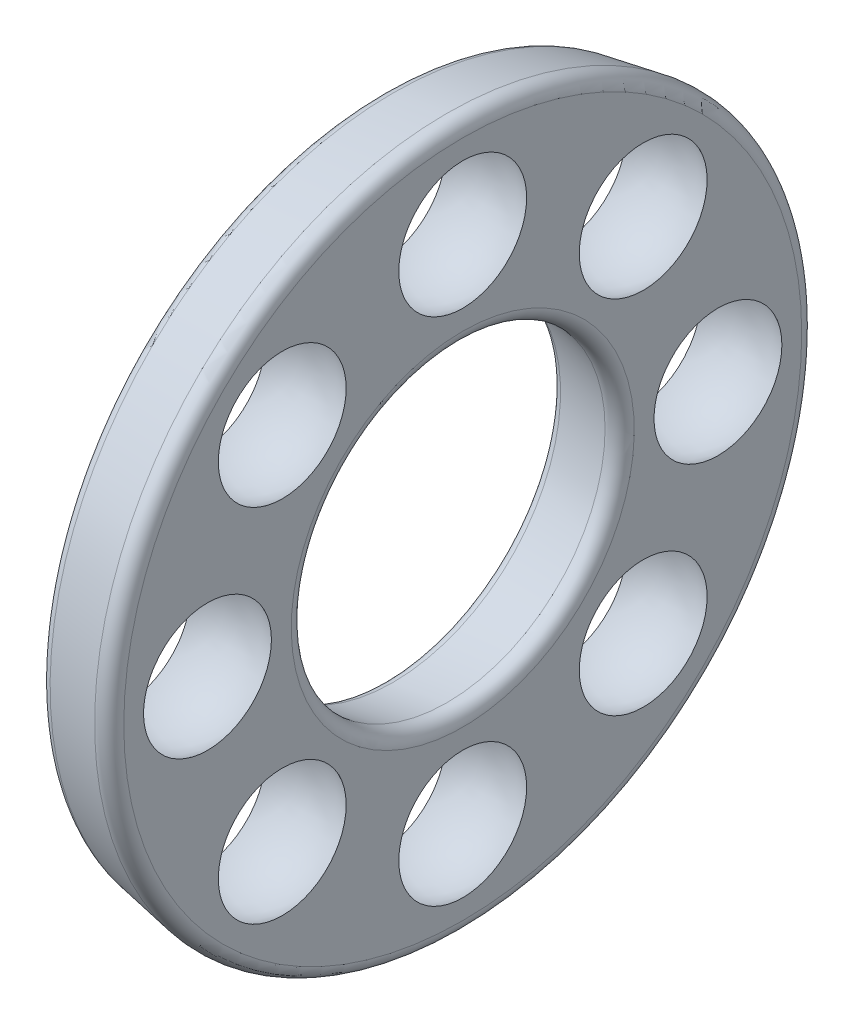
ISO-10303-21;
HEADER;
FILE_DESCRIPTION(('STEP AP214'),'2;1');
FILE_NAME('part.step','',(''),(''),'','','');
FILE_SCHEMA(('AUTOMOTIVE_DESIGN { 1 0 10303 214 1 1 1 1 }'));
ENDSEC;
DATA;
#1=APPLICATION_CONTEXT('core data for automotive mechanical design processes');
#2=APPLICATION_PROTOCOL_DEFINITION('international standard','automotive_design',2000,#1);
#3=PRODUCT_CONTEXT('',#1,'mechanical');
#4=PRODUCT('Part','Part','',(#3));
#5=PRODUCT_RELATED_PRODUCT_CATEGORY('part','',(#4));
#6=PRODUCT_DEFINITION_FORMATION('','',#4);
#7=PRODUCT_DEFINITION_CONTEXT('part definition',#1,'design');
#8=PRODUCT_DEFINITION('design','',#6,#7);
#9=PRODUCT_DEFINITION_SHAPE('','',#8);
#10=(LENGTH_UNIT() NAMED_UNIT(*) SI_UNIT(.MILLI.,.METRE.));
#11=(NAMED_UNIT(*) PLANE_ANGLE_UNIT() SI_UNIT($,.RADIAN.));
#12=(NAMED_UNIT(*) SI_UNIT($,.STERADIAN.) SOLID_ANGLE_UNIT());
#13=UNCERTAINTY_MEASURE_WITH_UNIT(LENGTH_MEASURE(1.E-05),#10,'distance_accuracy_value','');
#14=(GEOMETRIC_REPRESENTATION_CONTEXT(3) GLOBAL_UNCERTAINTY_ASSIGNED_CONTEXT((#13)) GLOBAL_UNIT_ASSIGNED_CONTEXT((#10,
#11,#12)) REPRESENTATION_CONTEXT('',''));
#15=CARTESIAN_POINT('',(0.,0.,0.));
#16=DIRECTION('',(0.,0.,1.));
#17=DIRECTION('',(1.,0.,0.));
#18=AXIS2_PLACEMENT_3D('',#15,#16,#17);
#19=CARTESIAN_POINT('',(3.15,8.5,0.));
#20=DIRECTION('',(-1.,0.,0.));
#21=DIRECTION('',(0.,0.,1.));
#22=AXIS2_PLACEMENT_3D('',#19,#20,#21);
#23=PLANE('',#22);
#24=CARTESIAN_POINT('',(3.15,0.,0.));
#25=DIRECTION('',(-1.,0.,0.));
#26=DIRECTION('',(0.,1.,0.));
#27=AXIS2_PLACEMENT_3D('',#24,#25,#26);
#28=CIRCLE('',#27,6.02867768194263);
#29=CARTESIAN_POINT('',(3.15,6.02867768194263,0.));
#30=VERTEX_POINT('',#29);
#31=EDGE_CURVE('E62',#30,#30,#28,.T.);
#32=ORIENTED_EDGE('',*,*,#31,.F.);
#33=EDGE_LOOP('',(#32));
#34=FACE_BOUND('',#33,.T.);
#35=CARTESIAN_POINT('',(3.15,8.5,0.));
#36=DIRECTION('',(1.,0.,0.));
#37=DIRECTION('',(0.,0.,-1.));
#38=AXIS2_PLACEMENT_3D('',#35,#36,#37);
#39=CIRCLE('',#38,2.12788627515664);
#40=CARTESIAN_POINT('',(3.15,8.5,-2.12788627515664));
#41=VERTEX_POINT('',#40);
#42=EDGE_CURVE('E10',#41,#41,#39,.T.);
#43=ORIENTED_EDGE('',*,*,#42,.T.);
#44=EDGE_LOOP('',(#43));
#45=FACE_BOUND('',#44,.T.);
#46=CARTESIAN_POINT('',(3.15,6.01040764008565,-6.01040764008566));
#47=DIRECTION('',(1.,0.,0.));
#48=DIRECTION('',(0.,0.,-1.));
#49=AXIS2_PLACEMENT_3D('',#46,#47,#48);
#50=CIRCLE('',#49,2.12788627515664);
#51=CARTESIAN_POINT('',(3.15,6.01040764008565,-8.1382939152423));
#52=VERTEX_POINT('',#51);
#53=EDGE_CURVE('E23',#52,#52,#50,.T.);
#54=ORIENTED_EDGE('',*,*,#53,.T.);
#55=EDGE_LOOP('',(#54));
#56=FACE_BOUND('',#55,.T.);
#57=CARTESIAN_POINT('',(3.15,0.,-8.5));
#58=DIRECTION('',(1.,0.,0.));
#59=DIRECTION('',(0.,0.,-1.));
#60=AXIS2_PLACEMENT_3D('',#57,#58,#59);
#61=CIRCLE('',#60,2.12788627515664);
#62=CARTESIAN_POINT('',(3.15,0.,-10.6278862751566));
#63=VERTEX_POINT('',#62);
#64=EDGE_CURVE('E28',#63,#63,#61,.T.);
#65=ORIENTED_EDGE('',*,*,#64,.T.);
#66=EDGE_LOOP('',(#65));
#67=FACE_BOUND('',#66,.T.);
#68=CARTESIAN_POINT('',(3.15,-6.01040764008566,-6.01040764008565));
#69=DIRECTION('',(1.,0.,0.));
#70=DIRECTION('',(0.,0.,-1.));
#71=AXIS2_PLACEMENT_3D('',#68,#69,#70);
#72=CIRCLE('',#71,2.12788627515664);
#73=CARTESIAN_POINT('',(3.15,-6.01040764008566,-8.13829391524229));
#74=VERTEX_POINT('',#73);
#75=EDGE_CURVE('E51',#74,#74,#72,.T.);
#76=ORIENTED_EDGE('',*,*,#75,.T.);
#77=EDGE_LOOP('',(#76));
#78=FACE_BOUND('',#77,.T.);
#79=CARTESIAN_POINT('',(3.15,-8.5,0.));
#80=DIRECTION('',(1.,0.,0.));
#81=DIRECTION('',(0.,0.,-1.));
#82=AXIS2_PLACEMENT_3D('',#79,#80,#81);
#83=CIRCLE('',#82,2.12788627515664);
#84=CARTESIAN_POINT('',(3.15,-8.5,-2.12788627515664));
#85=VERTEX_POINT('',#84);
#86=EDGE_CURVE('E48',#85,#85,#83,.T.);
#87=ORIENTED_EDGE('',*,*,#86,.T.);
#88=EDGE_LOOP('',(#87));
#89=FACE_BOUND('',#88,.T.);
#90=CARTESIAN_POINT('',(3.15,-6.01040764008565,6.01040764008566));
#91=DIRECTION('',(1.,0.,0.));
#92=DIRECTION('',(0.,0.,-1.));
#93=AXIS2_PLACEMENT_3D('',#90,#91,#92);
#94=CIRCLE('',#93,2.12788627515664);
#95=CARTESIAN_POINT('',(3.15,-6.01040764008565,3.88252136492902));
#96=VERTEX_POINT('',#95);
#97=EDGE_CURVE('E52',#96,#96,#94,.T.);
#98=ORIENTED_EDGE('',*,*,#97,.T.);
#99=EDGE_LOOP('',(#98));
#100=FACE_BOUND('',#99,.T.);
#101=CARTESIAN_POINT('',(3.15,0.,8.5));
#102=DIRECTION('',(1.,0.,0.));
#103=DIRECTION('',(0.,0.,-1.));
#104=AXIS2_PLACEMENT_3D('',#101,#102,#103);
#105=CIRCLE('',#104,2.12788627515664);
#106=CARTESIAN_POINT('',(3.15,0.,6.37211372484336));
#107=VERTEX_POINT('',#106);
#108=EDGE_CURVE('E31',#107,#107,#105,.T.);
#109=ORIENTED_EDGE('',*,*,#108,.T.);
#110=EDGE_LOOP('',(#109));
#111=FACE_BOUND('',#110,.T.);
#112=CARTESIAN_POINT('',(3.15,6.01040764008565,6.01040764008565));
#113=DIRECTION('',(1.,0.,0.));
#114=DIRECTION('',(0.,0.,-1.));
#115=AXIS2_PLACEMENT_3D('',#112,#113,#114);
#116=CIRCLE('',#115,2.12788627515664);
#117=CARTESIAN_POINT('',(3.15,6.01040764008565,3.88252136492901));
#118=VERTEX_POINT('',#117);
#119=EDGE_CURVE('E34',#118,#118,#116,.T.);
#120=ORIENTED_EDGE('',*,*,#119,.T.);
#121=EDGE_LOOP('',(#120));
#122=FACE_BOUND('',#121,.T.);
#123=CARTESIAN_POINT('',(3.15,0.,0.));
#124=DIRECTION('',(-1.,0.,0.));
#125=DIRECTION('',(0.,1.,0.));
#126=AXIS2_PLACEMENT_3D('',#123,#124,#125);
#127=CIRCLE('',#126,10.9713223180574);
#128=CARTESIAN_POINT('',(3.15,10.9713223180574,0.));
#129=VERTEX_POINT('',#128);
#130=EDGE_CURVE('E37',#129,#129,#127,.T.);
#131=ORIENTED_EDGE('',*,*,#130,.T.);
#132=EDGE_LOOP('',(#131));
#133=FACE_BOUND('',#132,.T.);
#134=ADVANCED_FACE('F15',(#34,#45,#56,#67,#78,#89,#100,#111,#122,#133),#23,.T.);
#135=CARTESIAN_POINT('',(5.85,8.5,0.));
#136=DIRECTION('',(1.,0.,0.));
#137=DIRECTION('',(0.,0.,-1.));
#138=AXIS2_PLACEMENT_3D('',#135,#136,#137);
#139=PLANE('',#138);
#140=CARTESIAN_POINT('',(5.85,0.,0.));
#141=DIRECTION('',(-1.,0.,0.));
#142=DIRECTION('',(0.,1.,0.));
#143=AXIS2_PLACEMENT_3D('',#140,#141,#142);
#144=CIRCLE('',#143,5.71128911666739);
#145=CARTESIAN_POINT('',(5.85,5.71128911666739,0.));
#146=VERTEX_POINT('',#145);
#147=EDGE_CURVE('E71',#146,#146,#144,.T.);
#148=ORIENTED_EDGE('',*,*,#147,.T.);
#149=EDGE_LOOP('',(#148));
#150=FACE_BOUND('',#149,.T.);
#151=CARTESIAN_POINT('',(5.85,8.5,0.));
#152=DIRECTION('',(-1.,0.,0.));
#153=DIRECTION('',(0.,0.,1.));
#154=AXIS2_PLACEMENT_3D('',#151,#152,#153);
#155=CIRCLE('',#154,2.12788627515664);
#156=CARTESIAN_POINT('',(5.85,8.5,2.12788627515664));
#157=VERTEX_POINT('',#156);
#158=EDGE_CURVE('E41',#157,#157,#155,.T.);
#159=ORIENTED_EDGE('',*,*,#158,.T.);
#160=EDGE_LOOP('',(#159));
#161=FACE_BOUND('',#160,.T.);
#162=CARTESIAN_POINT('',(5.85,6.01040764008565,-6.01040764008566));
#163=DIRECTION('',(-1.,0.,0.));
#164=DIRECTION('',(0.,0.,1.));
#165=AXIS2_PLACEMENT_3D('',#162,#163,#164);
#166=CIRCLE('',#165,2.12788627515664);
#167=CARTESIAN_POINT('',(5.85,6.01040764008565,-3.88252136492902));
#168=VERTEX_POINT('',#167);
#169=EDGE_CURVE('E38',#168,#168,#166,.T.);
#170=ORIENTED_EDGE('',*,*,#169,.T.);
#171=EDGE_LOOP('',(#170));
#172=FACE_BOUND('',#171,.T.);
#173=CARTESIAN_POINT('',(5.85,0.,-8.5));
#174=DIRECTION('',(-1.,0.,0.));
#175=DIRECTION('',(0.,0.,1.));
#176=AXIS2_PLACEMENT_3D('',#173,#174,#175);
#177=CIRCLE('',#176,2.12788627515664);
#178=CARTESIAN_POINT('',(5.85,0.,-6.37211372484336));
#179=VERTEX_POINT('',#178);
#180=EDGE_CURVE('E42',#179,#179,#177,.T.);
#181=ORIENTED_EDGE('',*,*,#180,.T.);
#182=EDGE_LOOP('',(#181));
#183=FACE_BOUND('',#182,.T.);
#184=CARTESIAN_POINT('',(5.85,-6.01040764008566,-6.01040764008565));
#185=DIRECTION('',(-1.,0.,0.));
#186=DIRECTION('',(0.,0.,1.));
#187=AXIS2_PLACEMENT_3D('',#184,#185,#186);
#188=CIRCLE('',#187,2.12788627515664);
#189=CARTESIAN_POINT('',(5.85,-6.01040764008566,-3.88252136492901));
#190=VERTEX_POINT('',#189);
#191=EDGE_CURVE('E57',#190,#190,#188,.T.);
#192=ORIENTED_EDGE('',*,*,#191,.T.);
#193=EDGE_LOOP('',(#192));
#194=FACE_BOUND('',#193,.T.);
#195=CARTESIAN_POINT('',(5.85,-8.5,0.));
#196=DIRECTION('',(-1.,0.,0.));
#197=DIRECTION('',(0.,0.,1.));
#198=AXIS2_PLACEMENT_3D('',#195,#196,#197);
#199=CIRCLE('',#198,2.12788627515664);
#200=CARTESIAN_POINT('',(5.85,-8.5,2.12788627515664));
#201=VERTEX_POINT('',#200);
#202=EDGE_CURVE('E65',#201,#201,#199,.T.);
#203=ORIENTED_EDGE('',*,*,#202,.T.);
#204=EDGE_LOOP('',(#203));
#205=FACE_BOUND('',#204,.T.);
#206=CARTESIAN_POINT('',(5.85,-6.01040764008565,6.01040764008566));
#207=DIRECTION('',(-1.,0.,0.));
#208=DIRECTION('',(0.,0.,1.));
#209=AXIS2_PLACEMENT_3D('',#206,#207,#208);
#210=CIRCLE('',#209,2.12788627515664);
#211=CARTESIAN_POINT('',(5.85,-6.01040764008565,8.1382939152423));
#212=VERTEX_POINT('',#211);
#213=EDGE_CURVE('E74',#212,#212,#210,.T.);
#214=ORIENTED_EDGE('',*,*,#213,.T.);
#215=EDGE_LOOP('',(#214));
#216=FACE_BOUND('',#215,.T.);
#217=CARTESIAN_POINT('',(5.85,0.,8.5));
#218=DIRECTION('',(-1.,0.,0.));
#219=DIRECTION('',(0.,0.,1.));
#220=AXIS2_PLACEMENT_3D('',#217,#218,#219);
#221=CIRCLE('',#220,2.12788627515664);
#222=CARTESIAN_POINT('',(5.85,0.,10.6278862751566));
#223=VERTEX_POINT('',#222);
#224=EDGE_CURVE('E61',#223,#223,#221,.T.);
#225=ORIENTED_EDGE('',*,*,#224,.T.);
#226=EDGE_LOOP('',(#225));
#227=FACE_BOUND('',#226,.T.);
#228=CARTESIAN_POINT('',(5.85,6.01040764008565,6.01040764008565));
#229=DIRECTION('',(-1.,0.,0.));
#230=DIRECTION('',(0.,0.,1.));
#231=AXIS2_PLACEMENT_3D('',#228,#229,#230);
#232=CIRCLE('',#231,2.12788627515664);
#233=CARTESIAN_POINT('',(5.85,6.01040764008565,8.13829391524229));
#234=VERTEX_POINT('',#233);
#235=EDGE_CURVE('E58',#234,#234,#232,.T.);
#236=ORIENTED_EDGE('',*,*,#235,.T.);
#237=EDGE_LOOP('',(#236));
#238=FACE_BOUND('',#237,.T.);
#239=CARTESIAN_POINT('',(5.85,0.,0.));
#240=DIRECTION('',(-1.,0.,0.));
#241=DIRECTION('',(0.,1.,0.));
#242=AXIS2_PLACEMENT_3D('',#239,#240,#241);
#243=CIRCLE('',#242,11.2887108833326);
#244=CARTESIAN_POINT('',(5.85,11.2887108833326,0.));
#245=VERTEX_POINT('',#244);
#246=EDGE_CURVE('E47',#245,#245,#243,.T.);
#247=ORIENTED_EDGE('',*,*,#246,.F.);
#248=EDGE_LOOP('',(#247));
#249=FACE_BOUND('',#248,.T.);
#250=ADVANCED_FACE('F96',(#150,#161,#172,#183,#194,#205,#216,#227,#238,#249),#139,.T.);
#251=CARTESIAN_POINT('',(4.5,6.01040764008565,6.01040764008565));
#252=DIRECTION('',(0.736360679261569,0.0599030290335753,0.673932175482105));
#253=DIRECTION('',(0.536733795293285,0.554729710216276,-0.635760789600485));
#254=AXIS2_PLACEMENT_3D('',#251,#252,#253);
#255=SPHERICAL_SURFACE('',#254,2.52);
#256=ORIENTED_EDGE('',*,*,#119,.F.);
#257=EDGE_LOOP('',(#256));
#258=FACE_BOUND('',#257,.T.);
#259=ORIENTED_EDGE('',*,*,#235,.F.);
#260=EDGE_LOOP('',(#259));
#261=FACE_BOUND('',#260,.T.);
#262=ADVANCED_FACE('F91',(#258,#261),#255,.F.);
#263=CARTESIAN_POINT('',(4.5,0.,8.5));
#264=DIRECTION('',(0.736360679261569,0.0599030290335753,0.673932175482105));
#265=DIRECTION('',(0.536733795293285,0.554729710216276,-0.635760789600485));
#266=AXIS2_PLACEMENT_3D('',#263,#264,#265);
#267=SPHERICAL_SURFACE('',#266,2.52);
#268=ORIENTED_EDGE('',*,*,#108,.F.);
#269=EDGE_LOOP('',(#268));
#270=FACE_BOUND('',#269,.T.);
#271=ORIENTED_EDGE('',*,*,#224,.F.);
#272=EDGE_LOOP('',(#271));
#273=FACE_BOUND('',#272,.T.);
#274=ADVANCED_FACE('F95',(#270,#273),#267,.F.);
#275=CARTESIAN_POINT('',(4.5,-6.01040764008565,6.01040764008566));
#276=DIRECTION('',(0.736360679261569,0.0599030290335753,0.673932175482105));
#277=DIRECTION('',(0.536733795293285,0.554729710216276,-0.635760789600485));
#278=AXIS2_PLACEMENT_3D('',#275,#276,#277);
#279=SPHERICAL_SURFACE('',#278,2.52);
#280=ORIENTED_EDGE('',*,*,#97,.F.);
#281=EDGE_LOOP('',(#280));
#282=FACE_BOUND('',#281,.T.);
#283=ORIENTED_EDGE('',*,*,#213,.F.);
#284=EDGE_LOOP('',(#283));
#285=FACE_BOUND('',#284,.T.);
#286=ADVANCED_FACE('F101',(#282,#285),#279,.F.);
#287=CARTESIAN_POINT('',(4.5,-8.5,0.));
#288=DIRECTION('',(0.736360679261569,0.0599030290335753,0.673932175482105));
#289=DIRECTION('',(0.536733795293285,0.554729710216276,-0.635760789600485));
#290=AXIS2_PLACEMENT_3D('',#287,#288,#289);
#291=SPHERICAL_SURFACE('',#290,2.52);
#292=ORIENTED_EDGE('',*,*,#86,.F.);
#293=EDGE_LOOP('',(#292));
#294=FACE_BOUND('',#293,.T.);
#295=ORIENTED_EDGE('',*,*,#202,.F.);
#296=EDGE_LOOP('',(#295));
#297=FACE_BOUND('',#296,.T.);
#298=ADVANCED_FACE('F105',(#294,#297),#291,.F.);
#299=CARTESIAN_POINT('',(4.5,-6.01040764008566,-6.01040764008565));
#300=DIRECTION('',(0.736360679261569,0.0599030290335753,0.673932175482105));
#301=DIRECTION('',(0.536733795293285,0.554729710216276,-0.635760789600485));
#302=AXIS2_PLACEMENT_3D('',#299,#300,#301);
#303=SPHERICAL_SURFACE('',#302,2.52);
#304=ORIENTED_EDGE('',*,*,#75,.F.);
#305=EDGE_LOOP('',(#304));
#306=FACE_BOUND('',#305,.T.);
#307=ORIENTED_EDGE('',*,*,#191,.F.);
#308=EDGE_LOOP('',(#307));
#309=FACE_BOUND('',#308,.T.);
#310=ADVANCED_FACE('F116',(#306,#309),#303,.F.);
#311=CARTESIAN_POINT('',(4.5,0.,-8.5));
#312=DIRECTION('',(0.736360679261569,0.0599030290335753,0.673932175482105));
#313=DIRECTION('',(0.536733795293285,0.554729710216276,-0.635760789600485));
#314=AXIS2_PLACEMENT_3D('',#311,#312,#313);
#315=SPHERICAL_SURFACE('',#314,2.52);
#316=ORIENTED_EDGE('',*,*,#64,.F.);
#317=EDGE_LOOP('',(#316));
#318=FACE_BOUND('',#317,.T.);
#319=ORIENTED_EDGE('',*,*,#180,.F.);
#320=EDGE_LOOP('',(#319));
#321=FACE_BOUND('',#320,.T.);
#322=ADVANCED_FACE('F119',(#318,#321),#315,.F.);
#323=CARTESIAN_POINT('',(4.5,6.01040764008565,-6.01040764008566));
#324=DIRECTION('',(0.736360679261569,0.0599030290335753,0.673932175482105));
#325=DIRECTION('',(0.536733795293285,0.554729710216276,-0.635760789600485));
#326=AXIS2_PLACEMENT_3D('',#323,#324,#325);
#327=SPHERICAL_SURFACE('',#326,2.52);
#328=ORIENTED_EDGE('',*,*,#53,.F.);
#329=EDGE_LOOP('',(#328));
#330=FACE_BOUND('',#329,.T.);
#331=ORIENTED_EDGE('',*,*,#169,.F.);
#332=EDGE_LOOP('',(#331));
#333=FACE_BOUND('',#332,.T.);
#334=ADVANCED_FACE('F123',(#330,#333),#327,.F.);
#335=CARTESIAN_POINT('',(4.5,8.5,0.));
#336=DIRECTION('',(0.736360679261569,0.0599030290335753,0.673932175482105));
#337=DIRECTION('',(0.536733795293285,0.554729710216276,-0.635760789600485));
#338=AXIS2_PLACEMENT_3D('',#335,#336,#337);
#339=SPHERICAL_SURFACE('',#338,2.52);
#340=ORIENTED_EDGE('',*,*,#42,.F.);
#341=EDGE_LOOP('',(#340));
#342=FACE_BOUND('',#341,.T.);
#343=ORIENTED_EDGE('',*,*,#158,.F.);
#344=EDGE_LOOP('',(#343));
#345=FACE_BOUND('',#344,.T.);
#346=ADVANCED_FACE('F127',(#342,#345),#339,.F.);
#347=CARTESIAN_POINT('',(3.6,0.,0.));
#348=DIRECTION('',(-1.,0.,0.));
#349=DIRECTION('',(0.,0.,1.));
#350=AXIS2_PLACEMENT_3D('',#347,#348,#349);
#351=TOROIDAL_SURFACE('',#350,6.02867768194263,0.449999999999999);
#352=ORIENTED_EDGE('',*,*,#31,.T.);
#353=EDGE_LOOP('',(#352));
#354=FACE_BOUND('',#353,.T.);
#355=CARTESIAN_POINT('',(3.52185832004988,0.,0.));
#356=DIRECTION('',(-1.,0.,0.));
#357=DIRECTION('',(0.,1.,0.));
#358=AXIS2_PLACEMENT_3D('',#355,#356,#357);
#359=CIRCLE('',#358,5.58551419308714);
#360=CARTESIAN_POINT('',(3.52185832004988,5.58551419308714,0.));
#361=VERTEX_POINT('',#360);
#362=EDGE_CURVE('E68',#361,#361,#359,.T.);
#363=ORIENTED_EDGE('',*,*,#362,.F.);
#364=EDGE_LOOP('',(#363));
#365=FACE_BOUND('',#364,.T.);
#366=ADVANCED_FACE('F138',(#354,#365),#351,.T.);
#367=DIRECTION('',(-0.984807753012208,0.17364817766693,0.));
#368=VECTOR('',#367,1.);
#369=CARTESIAN_POINT('',(-499000.,87993.3698863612,-2.15514479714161E-11));
#370=LINE('',#369,#368);
#371=CARTESIAN_POINT('',(35.1988834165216,0.,0.));
#372=DIRECTION('',(-1.,0.,0.));
#373=AXIS1_PLACEMENT('',#371,#372);
#374=SURFACE_OF_REVOLUTION('',#370,#373);
#375=ORIENTED_EDGE('',*,*,#362,.T.);
#376=EDGE_LOOP('',(#375));
#377=FACE_BOUND('',#376,.T.);
#378=CARTESIAN_POINT('',(5.32185832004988,0.,0.));
#379=DIRECTION('',(-1.,0.,0.));
#380=DIRECTION('',(0.,1.,0.));
#381=AXIS2_PLACEMENT_3D('',#378,#379,#380);
#382=CIRCLE('',#381,5.2681256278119);
#383=CARTESIAN_POINT('',(5.32185832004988,5.2681256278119,0.));
#384=VERTEX_POINT('',#383);
#385=EDGE_CURVE('E43',#384,#384,#382,.T.);
#386=ORIENTED_EDGE('',*,*,#385,.F.);
#387=EDGE_LOOP('',(#386));
#388=FACE_BOUND('',#387,.T.);
#389=ADVANCED_FACE('F141',(#377,#388),#374,.F.);
#390=DIRECTION('',(-0.984807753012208,-0.17364817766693,0.));
#391=VECTOR('',#390,1.);
#392=CARTESIAN_POINT('',(4.42185832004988,11.5731800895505,0.));
#393=LINE('',#392,#391);
#394=CARTESIAN_POINT('',(-61.2129075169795,0.,0.));
#395=DIRECTION('',(1.,0.,0.));
#396=AXIS1_PLACEMENT('',#394,#395);
#397=SURFACE_OF_REVOLUTION('',#393,#396);
#398=CARTESIAN_POINT('',(3.52185832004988,0.,0.));
#399=DIRECTION('',(-1.,0.,0.));
#400=DIRECTION('',(0.,1.,0.));
#401=AXIS2_PLACEMENT_3D('',#398,#399,#400);
#402=CIRCLE('',#401,11.4144858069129);
#403=CARTESIAN_POINT('',(3.52185832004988,11.4144858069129,0.));
#404=VERTEX_POINT('',#403);
#405=EDGE_CURVE('E46',#404,#404,#402,.T.);
#406=ORIENTED_EDGE('',*,*,#405,.F.);
#407=EDGE_LOOP('',(#406));
#408=FACE_BOUND('',#407,.T.);
#409=CARTESIAN_POINT('',(5.32185832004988,0.,0.));
#410=DIRECTION('',(-1.,0.,0.));
#411=DIRECTION('',(0.,1.,0.));
#412=AXIS2_PLACEMENT_3D('',#409,#410,#411);
#413=CIRCLE('',#412,11.7318743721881);
#414=CARTESIAN_POINT('',(5.32185832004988,11.7318743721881,0.));
#415=VERTEX_POINT('',#414);
#416=EDGE_CURVE('E85',#415,#415,#413,.T.);
#417=ORIENTED_EDGE('',*,*,#416,.T.);
#418=EDGE_LOOP('',(#417));
#419=FACE_BOUND('',#418,.T.);
#420=ADVANCED_FACE('F145',(#408,#419),#397,.F.);
#421=CARTESIAN_POINT('',(3.6,0.,0.));
#422=DIRECTION('',(-1.,0.,0.));
#423=DIRECTION('',(0.,0.,1.));
#424=AXIS2_PLACEMENT_3D('',#421,#422,#423);
#425=TOROIDAL_SURFACE('',#424,10.9713223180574,0.450000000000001);
#426=ORIENTED_EDGE('',*,*,#405,.T.);
#427=EDGE_LOOP('',(#426));
#428=FACE_BOUND('',#427,.T.);
#429=ORIENTED_EDGE('',*,*,#130,.F.);
#430=EDGE_LOOP('',(#429));
#431=FACE_BOUND('',#430,.T.);
#432=ADVANCED_FACE('F149',(#428,#431),#425,.T.);
#433=CARTESIAN_POINT('',(5.4,0.,0.));
#434=DIRECTION('',(-1.,0.,0.));
#435=DIRECTION('',(0.,0.,1.));
#436=AXIS2_PLACEMENT_3D('',#433,#434,#435);
#437=TOROIDAL_SURFACE('',#436,5.71128911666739,0.45);
#438=ORIENTED_EDGE('',*,*,#147,.F.);
#439=EDGE_LOOP('',(#438));
#440=FACE_BOUND('',#439,.T.);
#441=ORIENTED_EDGE('',*,*,#385,.T.);
#442=EDGE_LOOP('',(#441));
#443=FACE_BOUND('',#442,.T.);
#444=ADVANCED_FACE('F155',(#440,#443),#437,.T.);
#445=CARTESIAN_POINT('',(5.4,0.,0.));
#446=DIRECTION('',(-1.,0.,0.));
#447=DIRECTION('',(0.,0.,1.));
#448=AXIS2_PLACEMENT_3D('',#445,#446,#447);
#449=TOROIDAL_SURFACE('',#448,11.2887108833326,0.449999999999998);
#450=ORIENTED_EDGE('',*,*,#246,.T.);
#451=EDGE_LOOP('',(#450));
#452=FACE_BOUND('',#451,.T.);
#453=ORIENTED_EDGE('',*,*,#416,.F.);
#454=EDGE_LOOP('',(#453));
#455=FACE_BOUND('',#454,.T.);
#456=ADVANCED_FACE('F17',(#452,#455),#449,.T.);
#457=CLOSED_SHELL('',(#134,#250,#262,#274,#286,#298,#310,#322,#334,#346,#366,#389,#420,#432,
#444,#456));
#458=MANIFOLD_SOLID_BREP('B1',#457);
#459=ADVANCED_BREP_SHAPE_REPRESENTATION('',(#18,#458),#14);
#460=SHAPE_DEFINITION_REPRESENTATION(#9,#459);
ENDSEC;
END-ISO-10303-21;
